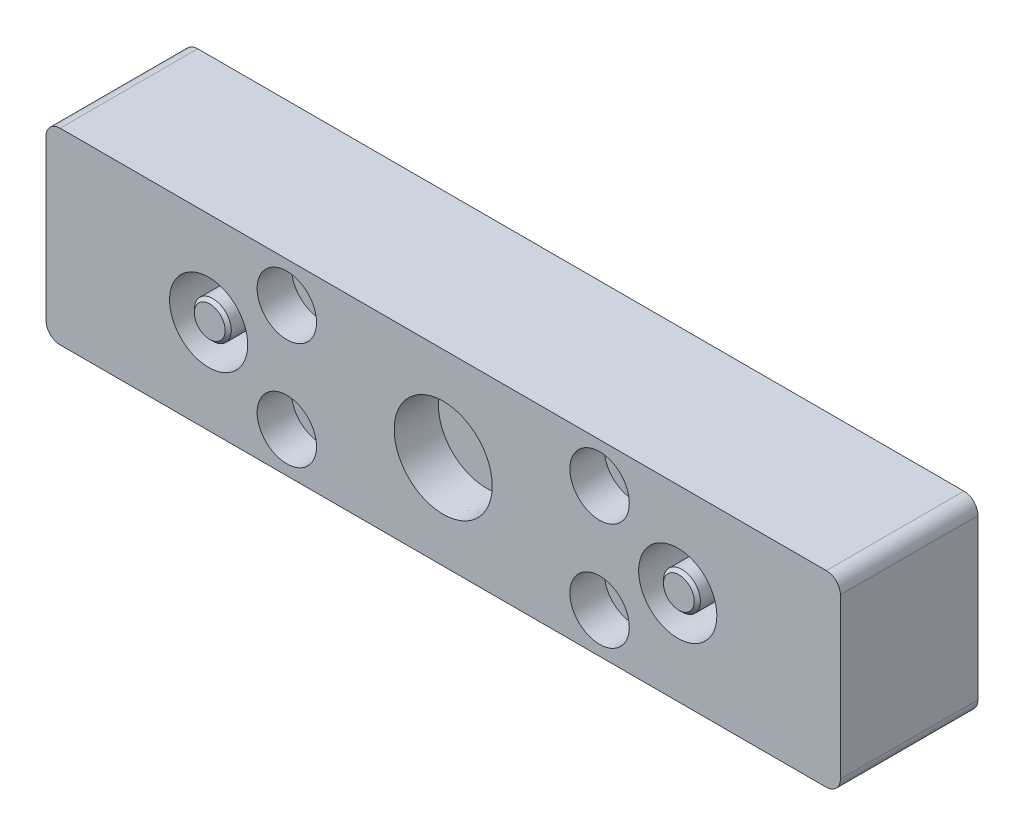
ISO-10303-21;
HEADER;
FILE_DESCRIPTION(('STEP AP214'),'2;1');
FILE_NAME('part.step','',(''),(''),'','','');
FILE_SCHEMA(('AUTOMOTIVE_DESIGN { 1 0 10303 214 1 1 1 1 }'));
ENDSEC;
DATA;
#1=APPLICATION_CONTEXT('core data for automotive mechanical design processes');
#2=APPLICATION_PROTOCOL_DEFINITION('international standard','automotive_design',2000,#1);
#3=PRODUCT_CONTEXT('',#1,'mechanical');
#4=PRODUCT('Part','Part','',(#3));
#5=PRODUCT_RELATED_PRODUCT_CATEGORY('part','',(#4));
#6=PRODUCT_DEFINITION_FORMATION('','',#4);
#7=PRODUCT_DEFINITION_CONTEXT('part definition',#1,'design');
#8=PRODUCT_DEFINITION('design','',#6,#7);
#9=PRODUCT_DEFINITION_SHAPE('','',#8);
#10=(LENGTH_UNIT() NAMED_UNIT(*) SI_UNIT(.MILLI.,.METRE.));
#11=(NAMED_UNIT(*) PLANE_ANGLE_UNIT() SI_UNIT($,.RADIAN.));
#12=(NAMED_UNIT(*) SI_UNIT($,.STERADIAN.) SOLID_ANGLE_UNIT());
#13=UNCERTAINTY_MEASURE_WITH_UNIT(LENGTH_MEASURE(1.E-05),#10,'distance_accuracy_value','');
#14=(GEOMETRIC_REPRESENTATION_CONTEXT(3) GLOBAL_UNCERTAINTY_ASSIGNED_CONTEXT((#13)) GLOBAL_UNIT_ASSIGNED_CONTEXT((#10,
#11,#12)) REPRESENTATION_CONTEXT('',''));
#15=CARTESIAN_POINT('',(0.,0.,0.));
#16=DIRECTION('',(0.,0.,1.));
#17=DIRECTION('',(1.,0.,0.));
#18=AXIS2_PLACEMENT_3D('',#15,#16,#17);
#19=CARTESIAN_POINT('',(40.1,-1.15470053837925,5.599));
#20=DIRECTION('',(-1.,0.,0.));
#21=DIRECTION('',(0.,0.,1.));
#22=AXIS2_PLACEMENT_3D('',#19,#20,#21);
#23=PLANE('',#22);
#24=DIRECTION('',(0.,-1.,0.));
#25=VECTOR('',#24,1.);
#26=CARTESIAN_POINT('',(40.1,0.,5.171821));
#27=LINE('',#26,#25);
#28=CARTESIAN_POINT('',(40.1,1.15470053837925,5.171821));
#29=VERTEX_POINT('',#28);
#30=CARTESIAN_POINT('',(40.1,-1.15470053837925,5.171821));
#31=VERTEX_POINT('',#30);
#32=EDGE_CURVE('E232',#29,#31,#27,.T.);
#33=ORIENTED_EDGE('',*,*,#32,.F.);
#34=DIRECTION('',(0.,0.,-1.));
#35=VECTOR('',#34,1.);
#36=CARTESIAN_POINT('',(40.1,1.15470053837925,5.599));
#37=LINE('',#36,#35);
#38=CARTESIAN_POINT('',(40.1,1.15470053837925,2.17000000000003));
#39=VERTEX_POINT('',#38);
#40=EDGE_CURVE('E115',#29,#39,#37,.T.);
#41=ORIENTED_EDGE('',*,*,#40,.T.);
#42=DIRECTION('',(0.,1.,0.));
#43=VECTOR('',#42,1.);
#44=CARTESIAN_POINT('',(40.1,-1.15470053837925,2.17000000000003));
#45=LINE('',#44,#43);
#46=CARTESIAN_POINT('',(40.1,-1.15470053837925,2.17000000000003));
#47=VERTEX_POINT('',#46);
#48=EDGE_CURVE('E100',#47,#39,#45,.T.);
#49=ORIENTED_EDGE('',*,*,#48,.F.);
#50=DIRECTION('',(0.,0.,-1.));
#51=VECTOR('',#50,1.);
#52=CARTESIAN_POINT('',(40.1,-1.15470053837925,5.599));
#53=LINE('',#52,#51);
#54=EDGE_CURVE('E96',#31,#47,#53,.T.);
#55=ORIENTED_EDGE('',*,*,#54,.F.);
#56=EDGE_LOOP('',(#33,#41,#49,#55));
#57=FACE_BOUND('',#56,.T.);
#58=ADVANCED_FACE('F16',(#57),#23,.T.);
#59=CARTESIAN_POINT('',(40.1,1.15470053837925,5.599));
#60=DIRECTION('',(-0.5,-0.866025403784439,0.));
#61=DIRECTION('',(0.866025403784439,-0.5,0.));
#62=AXIS2_PLACEMENT_3D('',#59,#60,#61);
#63=PLANE('',#62);
#64=DIRECTION('',(0.866025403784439,-0.5,0.));
#65=VECTOR('',#64,1.);
#66=CARTESIAN_POINT('',(39.1,1.73205080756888,5.171821));
#67=LINE('',#66,#65);
#68=CARTESIAN_POINT('',(38.1,2.30940107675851,5.171821));
#69=VERTEX_POINT('',#68);
#70=EDGE_CURVE('E229',#69,#29,#67,.T.);
#71=ORIENTED_EDGE('',*,*,#70,.F.);
#72=DIRECTION('',(0.,0.,-1.));
#73=VECTOR('',#72,1.);
#74=CARTESIAN_POINT('',(38.1,2.30940107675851,5.599));
#75=LINE('',#74,#73);
#76=CARTESIAN_POINT('',(38.1,2.30940107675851,2.17000000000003));
#77=VERTEX_POINT('',#76);
#78=EDGE_CURVE('E113',#69,#77,#75,.T.);
#79=ORIENTED_EDGE('',*,*,#78,.T.);
#80=DIRECTION('',(-0.866025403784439,0.5,0.));
#81=VECTOR('',#80,1.);
#82=CARTESIAN_POINT('',(40.1,1.15470053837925,2.17000000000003));
#83=LINE('',#82,#81);
#84=EDGE_CURVE('E172',#39,#77,#83,.T.);
#85=ORIENTED_EDGE('',*,*,#84,.F.);
#86=ORIENTED_EDGE('',*,*,#40,.F.);
#87=EDGE_LOOP('',(#71,#79,#85,#86));
#88=FACE_BOUND('',#87,.T.);
#89=ADVANCED_FACE('F198',(#88),#63,.T.);
#90=CARTESIAN_POINT('',(38.1,2.30940107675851,5.599));
#91=DIRECTION('',(0.5,-0.866025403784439,0.));
#92=DIRECTION('',(0.866025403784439,0.5,0.));
#93=AXIS2_PLACEMENT_3D('',#90,#91,#92);
#94=PLANE('',#93);
#95=DIRECTION('',(0.866025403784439,0.5,0.));
#96=VECTOR('',#95,1.);
#97=CARTESIAN_POINT('',(37.1,1.73205080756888,5.171821));
#98=LINE('',#97,#96);
#99=CARTESIAN_POINT('',(36.1,1.15470053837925,5.171821));
#100=VERTEX_POINT('',#99);
#101=EDGE_CURVE('E183',#100,#69,#98,.T.);
#102=ORIENTED_EDGE('',*,*,#101,.F.);
#103=DIRECTION('',(0.,0.,-1.));
#104=VECTOR('',#103,1.);
#105=CARTESIAN_POINT('',(36.1,1.15470053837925,5.599));
#106=LINE('',#105,#104);
#107=CARTESIAN_POINT('',(36.1,1.15470053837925,2.17000000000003));
#108=VERTEX_POINT('',#107);
#109=EDGE_CURVE('E111',#100,#108,#106,.T.);
#110=ORIENTED_EDGE('',*,*,#109,.T.);
#111=DIRECTION('',(-0.866025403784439,-0.5,0.));
#112=VECTOR('',#111,1.);
#113=CARTESIAN_POINT('',(38.1,2.30940107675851,2.17000000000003));
#114=LINE('',#113,#112);
#115=EDGE_CURVE('E106',#77,#108,#114,.T.);
#116=ORIENTED_EDGE('',*,*,#115,.F.);
#117=ORIENTED_EDGE('',*,*,#78,.F.);
#118=EDGE_LOOP('',(#102,#110,#116,#117));
#119=FACE_BOUND('',#118,.T.);
#120=ADVANCED_FACE('F179',(#119),#94,.T.);
#121=CARTESIAN_POINT('',(36.1,1.15470053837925,5.599));
#122=DIRECTION('',(1.,0.,0.));
#123=DIRECTION('',(0.,0.,-1.));
#124=AXIS2_PLACEMENT_3D('',#121,#122,#123);
#125=PLANE('',#124);
#126=DIRECTION('',(0.,1.,0.));
#127=VECTOR('',#126,1.);
#128=CARTESIAN_POINT('',(36.1,0.,5.171821));
#129=LINE('',#128,#127);
#130=CARTESIAN_POINT('',(36.1,-1.15470053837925,5.171821));
#131=VERTEX_POINT('',#130);
#132=EDGE_CURVE('E187',#131,#100,#129,.T.);
#133=ORIENTED_EDGE('',*,*,#132,.F.);
#134=DIRECTION('',(0.,0.,-1.));
#135=VECTOR('',#134,1.);
#136=CARTESIAN_POINT('',(36.1,-1.15470053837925,5.599));
#137=LINE('',#136,#135);
#138=CARTESIAN_POINT('',(36.1,-1.15470053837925,2.17000000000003));
#139=VERTEX_POINT('',#138);
#140=EDGE_CURVE('E77',#131,#139,#137,.T.);
#141=ORIENTED_EDGE('',*,*,#140,.T.);
#142=DIRECTION('',(0.,-1.,0.));
#143=VECTOR('',#142,1.);
#144=CARTESIAN_POINT('',(36.1,1.15470053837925,2.17000000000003));
#145=LINE('',#144,#143);
#146=EDGE_CURVE('E104',#108,#139,#145,.T.);
#147=ORIENTED_EDGE('',*,*,#146,.F.);
#148=ORIENTED_EDGE('',*,*,#109,.F.);
#149=EDGE_LOOP('',(#133,#141,#147,#148));
#150=FACE_BOUND('',#149,.T.);
#151=ADVANCED_FACE('F184',(#150),#125,.T.);
#152=CARTESIAN_POINT('',(38.1,0.,2.17000000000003));
#153=DIRECTION('',(0.,0.,-1.));
#154=DIRECTION('',(-1.,0.,0.));
#155=AXIS2_PLACEMENT_3D('',#152,#153,#154);
#156=PLANE('',#155);
#157=CARTESIAN_POINT('',(38.1,0.,2.17000000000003));
#158=DIRECTION('',(0.,0.,-1.));
#159=DIRECTION('',(-1.,0.,0.));
#160=AXIS2_PLACEMENT_3D('',#157,#158,#159);
#161=CIRCLE('',#160,6.72);
#162=CARTESIAN_POINT('',(31.38,0.,2.17000000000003));
#163=VERTEX_POINT('',#162);
#164=EDGE_CURVE('E118',#163,#163,#161,.T.);
#165=ORIENTED_EDGE('',*,*,#164,.T.);
#166=EDGE_LOOP('',(#165));
#167=FACE_BOUND('',#166,.T.);
#168=DIRECTION('',(0.866025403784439,-0.5,0.));
#169=VECTOR('',#168,1.);
#170=CARTESIAN_POINT('',(36.1,-1.15470053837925,2.17000000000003));
#171=LINE('',#170,#169);
#172=CARTESIAN_POINT('',(38.1,-2.3094010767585,2.17000000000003));
#173=VERTEX_POINT('',#172);
#174=EDGE_CURVE('E86',#139,#173,#171,.T.);
#175=ORIENTED_EDGE('',*,*,#174,.T.);
#176=DIRECTION('',(0.866025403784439,0.5,0.));
#177=VECTOR('',#176,1.);
#178=CARTESIAN_POINT('',(38.1,-2.3094010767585,2.17000000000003));
#179=LINE('',#178,#177);
#180=EDGE_CURVE('E93',#173,#47,#179,.T.);
#181=ORIENTED_EDGE('',*,*,#180,.T.);
#182=ORIENTED_EDGE('',*,*,#48,.T.);
#183=ORIENTED_EDGE('',*,*,#84,.T.);
#184=ORIENTED_EDGE('',*,*,#115,.T.);
#185=ORIENTED_EDGE('',*,*,#146,.T.);
#186=EDGE_LOOP('',(#175,#181,#182,#183,#184,#185));
#187=FACE_BOUND('',#186,.T.);
#188=ADVANCED_FACE('F102',(#167,#187),#156,.T.);
#189=CARTESIAN_POINT('',(38.1,-2.3094010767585,5.599));
#190=DIRECTION('',(-0.5,0.866025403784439,0.));
#191=DIRECTION('',(-0.866025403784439,-0.5,0.));
#192=AXIS2_PLACEMENT_3D('',#189,#190,#191);
#193=PLANE('',#192);
#194=DIRECTION('',(-0.866025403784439,-0.5,0.));
#195=VECTOR('',#194,1.);
#196=CARTESIAN_POINT('',(39.1,-1.73205080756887,5.171821));
#197=LINE('',#196,#195);
#198=CARTESIAN_POINT('',(38.1,-2.30940107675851,5.171821));
#199=VERTEX_POINT('',#198);
#200=EDGE_CURVE('E35',#31,#199,#197,.T.);
#201=ORIENTED_EDGE('',*,*,#200,.F.);
#202=ORIENTED_EDGE('',*,*,#54,.T.);
#203=ORIENTED_EDGE('',*,*,#180,.F.);
#204=DIRECTION('',(0.,0.,-1.));
#205=VECTOR('',#204,1.);
#206=CARTESIAN_POINT('',(38.1,-2.3094010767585,5.599));
#207=LINE('',#206,#205);
#208=EDGE_CURVE('E82',#199,#173,#207,.T.);
#209=ORIENTED_EDGE('',*,*,#208,.F.);
#210=EDGE_LOOP('',(#201,#202,#203,#209));
#211=FACE_BOUND('',#210,.T.);
#212=ADVANCED_FACE('F94',(#211),#193,.T.);
#213=CARTESIAN_POINT('',(36.1,-1.15470053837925,5.599));
#214=DIRECTION('',(0.5,0.866025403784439,0.));
#215=DIRECTION('',(-0.866025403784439,0.5,0.));
#216=AXIS2_PLACEMENT_3D('',#213,#214,#215);
#217=PLANE('',#216);
#218=DIRECTION('',(-0.866025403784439,0.5,0.));
#219=VECTOR('',#218,1.);
#220=CARTESIAN_POINT('',(37.1,-1.73205080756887,5.171821));
#221=LINE('',#220,#219);
#222=EDGE_CURVE('E90',#199,#131,#221,.T.);
#223=ORIENTED_EDGE('',*,*,#222,.F.);
#224=ORIENTED_EDGE('',*,*,#208,.T.);
#225=ORIENTED_EDGE('',*,*,#174,.F.);
#226=ORIENTED_EDGE('',*,*,#140,.F.);
#227=EDGE_LOOP('',(#223,#224,#225,#226));
#228=FACE_BOUND('',#227,.T.);
#229=ADVANCED_FACE('F84',(#228),#217,.T.);
#230=CARTESIAN_POINT('',(38.1,0.,2.17000000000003));
#231=DIRECTION('',(0.,0.,-1.));
#232=DIRECTION('',(-1.,0.,0.));
#233=AXIS2_PLACEMENT_3D('',#230,#231,#232);
#234=CYLINDRICAL_SURFACE('',#233,6.72);
#235=CARTESIAN_POINT('',(38.1,0.,2.297));
#236=DIRECTION('',(0.,0.,-1.));
#237=DIRECTION('',(-1.,0.,0.));
#238=AXIS2_PLACEMENT_3D('',#235,#236,#237);
#239=CIRCLE('',#238,6.72);
#240=CARTESIAN_POINT('',(31.38,0.,2.297));
#241=VERTEX_POINT('',#240);
#242=EDGE_CURVE('E26',#241,#241,#239,.F.);
#243=ORIENTED_EDGE('',*,*,#242,.F.);
#244=EDGE_LOOP('',(#243));
#245=FACE_BOUND('',#244,.T.);
#246=ORIENTED_EDGE('',*,*,#164,.F.);
#247=EDGE_LOOP('',(#246));
#248=FACE_BOUND('',#247,.T.);
#249=ADVANCED_FACE('F197',(#245,#248),#234,.T.);
#250=CARTESIAN_POINT('',(38.1,0.,5.171821));
#251=DIRECTION('',(0.,0.,1.));
#252=DIRECTION('',(1.,0.,0.));
#253=AXIS2_PLACEMENT_3D('',#250,#251,#252);
#254=PLANE('',#253);
#255=ORIENTED_EDGE('',*,*,#32,.T.);
#256=ORIENTED_EDGE('',*,*,#200,.T.);
#257=ORIENTED_EDGE('',*,*,#222,.T.);
#258=ORIENTED_EDGE('',*,*,#132,.T.);
#259=ORIENTED_EDGE('',*,*,#101,.T.);
#260=ORIENTED_EDGE('',*,*,#70,.T.);
#261=EDGE_LOOP('',(#255,#256,#257,#258,#259,#260));
#262=FACE_BOUND('',#261,.T.);
#263=ADVANCED_FACE('F214',(#262),#254,.F.);
#264=CARTESIAN_POINT('',(-36.1,-1.15470053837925,5.599));
#265=DIRECTION('',(-1.,0.,0.));
#266=DIRECTION('',(0.,0.,1.));
#267=AXIS2_PLACEMENT_3D('',#264,#265,#266);
#268=PLANE('',#267);
#269=DIRECTION('',(0.,-1.,0.));
#270=VECTOR('',#269,1.);
#271=CARTESIAN_POINT('',(-36.1,0.,5.171821));
#272=LINE('',#271,#270);
#273=CARTESIAN_POINT('',(-36.1,1.15470053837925,5.171821));
#274=VERTEX_POINT('',#273);
#275=CARTESIAN_POINT('',(-36.1,-1.15470053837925,5.171821));
#276=VERTEX_POINT('',#275);
#277=EDGE_CURVE('E386',#274,#276,#272,.T.);
#278=ORIENTED_EDGE('',*,*,#277,.F.);
#279=DIRECTION('',(0.,0.,-1.));
#280=VECTOR('',#279,1.);
#281=CARTESIAN_POINT('',(-36.1,1.15470053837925,5.599));
#282=LINE('',#281,#280);
#283=CARTESIAN_POINT('',(-36.1,1.15470053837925,2.17));
#284=VERTEX_POINT('',#283);
#285=EDGE_CURVE('E157',#274,#284,#282,.T.);
#286=ORIENTED_EDGE('',*,*,#285,.T.);
#287=DIRECTION('',(0.,1.,0.));
#288=VECTOR('',#287,1.);
#289=CARTESIAN_POINT('',(-36.1,-1.15470053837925,2.17));
#290=LINE('',#289,#288);
#291=CARTESIAN_POINT('',(-36.1,-1.15470053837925,2.17));
#292=VERTEX_POINT('',#291);
#293=EDGE_CURVE('E129',#292,#284,#290,.T.);
#294=ORIENTED_EDGE('',*,*,#293,.F.);
#295=DIRECTION('',(0.,0.,-1.));
#296=VECTOR('',#295,1.);
#297=CARTESIAN_POINT('',(-36.1,-1.15470053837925,5.599));
#298=LINE('',#297,#296);
#299=EDGE_CURVE('E159',#276,#292,#298,.T.);
#300=ORIENTED_EDGE('',*,*,#299,.F.);
#301=EDGE_LOOP('',(#278,#286,#294,#300));
#302=FACE_BOUND('',#301,.T.);
#303=ADVANCED_FACE('F517',(#302),#268,.T.);
#304=CARTESIAN_POINT('',(-36.1,1.15470053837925,5.599));
#305=DIRECTION('',(-0.5,-0.866025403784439,0.));
#306=DIRECTION('',(0.866025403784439,-0.5,0.));
#307=AXIS2_PLACEMENT_3D('',#304,#305,#306);
#308=PLANE('',#307);
#309=DIRECTION('',(0.866025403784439,-0.5,0.));
#310=VECTOR('',#309,1.);
#311=CARTESIAN_POINT('',(-37.1,1.73205080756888,5.171821));
#312=LINE('',#311,#310);
#313=CARTESIAN_POINT('',(-38.1,2.30940107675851,5.171821));
#314=VERTEX_POINT('',#313);
#315=EDGE_CURVE('E383',#314,#274,#312,.T.);
#316=ORIENTED_EDGE('',*,*,#315,.F.);
#317=DIRECTION('',(0.,0.,-1.));
#318=VECTOR('',#317,1.);
#319=CARTESIAN_POINT('',(-38.1,2.30940107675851,5.599));
#320=LINE('',#319,#318);
#321=CARTESIAN_POINT('',(-38.1,2.30940107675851,2.17));
#322=VERTEX_POINT('',#321);
#323=EDGE_CURVE('E155',#314,#322,#320,.T.);
#324=ORIENTED_EDGE('',*,*,#323,.T.);
#325=DIRECTION('',(-0.866025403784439,0.5,0.));
#326=VECTOR('',#325,1.);
#327=CARTESIAN_POINT('',(-36.1,1.15470053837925,2.17));
#328=LINE('',#327,#326);
#329=EDGE_CURVE('E135',#284,#322,#328,.T.);
#330=ORIENTED_EDGE('',*,*,#329,.F.);
#331=ORIENTED_EDGE('',*,*,#285,.F.);
#332=EDGE_LOOP('',(#316,#324,#330,#331));
#333=FACE_BOUND('',#332,.T.);
#334=ADVANCED_FACE('F513',(#333),#308,.T.);
#335=CARTESIAN_POINT('',(-38.1,2.30940107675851,5.599));
#336=DIRECTION('',(0.5,-0.866025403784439,0.));
#337=DIRECTION('',(0.866025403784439,0.5,0.));
#338=AXIS2_PLACEMENT_3D('',#335,#336,#337);
#339=PLANE('',#338);
#340=DIRECTION('',(0.866025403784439,0.5,0.));
#341=VECTOR('',#340,1.);
#342=CARTESIAN_POINT('',(-39.1,1.73205080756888,5.171821));
#343=LINE('',#342,#341);
#344=CARTESIAN_POINT('',(-40.1,1.15470053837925,5.171821));
#345=VERTEX_POINT('',#344);
#346=EDGE_CURVE('E380',#345,#314,#343,.T.);
#347=ORIENTED_EDGE('',*,*,#346,.F.);
#348=DIRECTION('',(0.,0.,-1.));
#349=VECTOR('',#348,1.);
#350=CARTESIAN_POINT('',(-40.1,1.15470053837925,5.599));
#351=LINE('',#350,#349);
#352=CARTESIAN_POINT('',(-40.1,1.15470053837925,2.17));
#353=VERTEX_POINT('',#352);
#354=EDGE_CURVE('E153',#345,#353,#351,.T.);
#355=ORIENTED_EDGE('',*,*,#354,.T.);
#356=DIRECTION('',(-0.866025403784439,-0.5,0.));
#357=VECTOR('',#356,1.);
#358=CARTESIAN_POINT('',(-38.1,2.30940107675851,2.17));
#359=LINE('',#358,#357);
#360=EDGE_CURVE('E141',#322,#353,#359,.T.);
#361=ORIENTED_EDGE('',*,*,#360,.F.);
#362=ORIENTED_EDGE('',*,*,#323,.F.);
#363=EDGE_LOOP('',(#347,#355,#361,#362));
#364=FACE_BOUND('',#363,.T.);
#365=ADVANCED_FACE('F509',(#364),#339,.T.);
#366=CARTESIAN_POINT('',(-40.1,1.15470053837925,5.599));
#367=DIRECTION('',(1.,0.,0.));
#368=DIRECTION('',(0.,0.,-1.));
#369=AXIS2_PLACEMENT_3D('',#366,#367,#368);
#370=PLANE('',#369);
#371=DIRECTION('',(0.,1.,0.));
#372=VECTOR('',#371,1.);
#373=CARTESIAN_POINT('',(-40.1,0.,5.171821));
#374=LINE('',#373,#372);
#375=CARTESIAN_POINT('',(-40.1,-1.15470053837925,5.171821));
#376=VERTEX_POINT('',#375);
#377=EDGE_CURVE('E377',#376,#345,#374,.T.);
#378=ORIENTED_EDGE('',*,*,#377,.F.);
#379=DIRECTION('',(0.,0.,-1.));
#380=VECTOR('',#379,1.);
#381=CARTESIAN_POINT('',(-40.1,-1.15470053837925,5.599));
#382=LINE('',#381,#380);
#383=CARTESIAN_POINT('',(-40.1,-1.15470053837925,2.17));
#384=VERTEX_POINT('',#383);
#385=EDGE_CURVE('E151',#376,#384,#382,.T.);
#386=ORIENTED_EDGE('',*,*,#385,.T.);
#387=DIRECTION('',(0.,-1.,0.));
#388=VECTOR('',#387,1.);
#389=CARTESIAN_POINT('',(-40.1,1.15470053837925,2.17));
#390=LINE('',#389,#388);
#391=EDGE_CURVE('E144',#353,#384,#390,.T.);
#392=ORIENTED_EDGE('',*,*,#391,.F.);
#393=ORIENTED_EDGE('',*,*,#354,.F.);
#394=EDGE_LOOP('',(#378,#386,#392,#393));
#395=FACE_BOUND('',#394,.T.);
#396=ADVANCED_FACE('F506',(#395),#370,.T.);
#397=CARTESIAN_POINT('',(-38.1,0.,2.17));
#398=DIRECTION('',(0.,0.,-1.));
#399=DIRECTION('',(-1.,0.,0.));
#400=AXIS2_PLACEMENT_3D('',#397,#398,#399);
#401=PLANE('',#400);
#402=CARTESIAN_POINT('',(-38.1,0.,2.17));
#403=DIRECTION('',(0.,0.,-1.));
#404=DIRECTION('',(-1.,0.,0.));
#405=AXIS2_PLACEMENT_3D('',#402,#403,#404);
#406=CIRCLE('',#405,6.72);
#407=CARTESIAN_POINT('',(-44.82,0.,2.17));
#408=VERTEX_POINT('',#407);
#409=EDGE_CURVE('E161',#408,#408,#406,.T.);
#410=ORIENTED_EDGE('',*,*,#409,.T.);
#411=EDGE_LOOP('',(#410));
#412=FACE_BOUND('',#411,.T.);
#413=DIRECTION('',(0.866025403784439,-0.5,0.));
#414=VECTOR('',#413,1.);
#415=CARTESIAN_POINT('',(-40.1,-1.15470053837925,2.17));
#416=LINE('',#415,#414);
#417=CARTESIAN_POINT('',(-38.1,-2.3094010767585,2.17));
#418=VERTEX_POINT('',#417);
#419=EDGE_CURVE('E147',#384,#418,#416,.T.);
#420=ORIENTED_EDGE('',*,*,#419,.T.);
#421=DIRECTION('',(0.866025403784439,0.5,0.));
#422=VECTOR('',#421,1.);
#423=CARTESIAN_POINT('',(-38.1,-2.3094010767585,2.17));
#424=LINE('',#423,#422);
#425=EDGE_CURVE('E125',#418,#292,#424,.T.);
#426=ORIENTED_EDGE('',*,*,#425,.T.);
#427=ORIENTED_EDGE('',*,*,#293,.T.);
#428=ORIENTED_EDGE('',*,*,#329,.T.);
#429=ORIENTED_EDGE('',*,*,#360,.T.);
#430=ORIENTED_EDGE('',*,*,#391,.T.);
#431=EDGE_LOOP('',(#420,#426,#427,#428,#429,#430));
#432=FACE_BOUND('',#431,.T.);
#433=ADVANCED_FACE('F505',(#412,#432),#401,.T.);
#434=CARTESIAN_POINT('',(-38.1,-2.3094010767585,5.599));
#435=DIRECTION('',(-0.5,0.866025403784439,0.));
#436=DIRECTION('',(-0.866025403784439,-0.5,0.));
#437=AXIS2_PLACEMENT_3D('',#434,#435,#436);
#438=PLANE('',#437);
#439=DIRECTION('',(-0.866025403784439,-0.5,0.));
#440=VECTOR('',#439,1.);
#441=CARTESIAN_POINT('',(-37.1,-1.73205080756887,5.171821));
#442=LINE('',#441,#440);
#443=CARTESIAN_POINT('',(-38.1,-2.30940107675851,5.171821));
#444=VERTEX_POINT('',#443);
#445=EDGE_CURVE('E389',#276,#444,#442,.T.);
#446=ORIENTED_EDGE('',*,*,#445,.F.);
#447=ORIENTED_EDGE('',*,*,#299,.T.);
#448=ORIENTED_EDGE('',*,*,#425,.F.);
#449=DIRECTION('',(0.,0.,-1.));
#450=VECTOR('',#449,1.);
#451=CARTESIAN_POINT('',(-38.1,-2.3094010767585,5.599));
#452=LINE('',#451,#450);
#453=EDGE_CURVE('E149',#444,#418,#452,.T.);
#454=ORIENTED_EDGE('',*,*,#453,.F.);
#455=EDGE_LOOP('',(#446,#447,#448,#454));
#456=FACE_BOUND('',#455,.T.);
#457=ADVANCED_FACE('F503',(#456),#438,.T.);
#458=CARTESIAN_POINT('',(-40.1,-1.15470053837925,5.599));
#459=DIRECTION('',(0.5,0.866025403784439,0.));
#460=DIRECTION('',(-0.866025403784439,0.5,0.));
#461=AXIS2_PLACEMENT_3D('',#458,#459,#460);
#462=PLANE('',#461);
#463=DIRECTION('',(-0.866025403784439,0.5,0.));
#464=VECTOR('',#463,1.);
#465=CARTESIAN_POINT('',(-39.1,-1.73205080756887,5.171821));
#466=LINE('',#465,#464);
#467=EDGE_CURVE('E374',#444,#376,#466,.T.);
#468=ORIENTED_EDGE('',*,*,#467,.F.);
#469=ORIENTED_EDGE('',*,*,#453,.T.);
#470=ORIENTED_EDGE('',*,*,#419,.F.);
#471=ORIENTED_EDGE('',*,*,#385,.F.);
#472=EDGE_LOOP('',(#468,#469,#470,#471));
#473=FACE_BOUND('',#472,.T.);
#474=ADVANCED_FACE('F499',(#473),#462,.T.);
#475=CARTESIAN_POINT('',(-38.1,0.,2.17));
#476=DIRECTION('',(0.,0.,-1.));
#477=DIRECTION('',(-1.,0.,0.));
#478=AXIS2_PLACEMENT_3D('',#475,#476,#477);
#479=CYLINDRICAL_SURFACE('',#478,6.72);
#480=CARTESIAN_POINT('',(-38.1,0.,2.297));
#481=DIRECTION('',(0.,0.,-1.));
#482=DIRECTION('',(-1.,0.,0.));
#483=AXIS2_PLACEMENT_3D('',#480,#481,#482);
#484=CIRCLE('',#483,6.72);
#485=CARTESIAN_POINT('',(-44.82,0.,2.297));
#486=VERTEX_POINT('',#485);
#487=EDGE_CURVE('E10',#486,#486,#484,.F.);
#488=ORIENTED_EDGE('',*,*,#487,.F.);
#489=EDGE_LOOP('',(#488));
#490=FACE_BOUND('',#489,.T.);
#491=ORIENTED_EDGE('',*,*,#409,.F.);
#492=EDGE_LOOP('',(#491));
#493=FACE_BOUND('',#492,.T.);
#494=ADVANCED_FACE('F502',(#490,#493),#479,.T.);
#495=CARTESIAN_POINT('',(-38.1,0.,5.171821));
#496=DIRECTION('',(0.,0.,1.));
#497=DIRECTION('',(1.,0.,0.));
#498=AXIS2_PLACEMENT_3D('',#495,#496,#497);
#499=PLANE('',#498);
#500=ORIENTED_EDGE('',*,*,#277,.T.);
#501=ORIENTED_EDGE('',*,*,#445,.T.);
#502=ORIENTED_EDGE('',*,*,#467,.T.);
#503=ORIENTED_EDGE('',*,*,#377,.T.);
#504=ORIENTED_EDGE('',*,*,#346,.T.);
#505=ORIENTED_EDGE('',*,*,#315,.T.);
#506=EDGE_LOOP('',(#500,#501,#502,#503,#504,#505));
#507=FACE_BOUND('',#506,.T.);
#508=ADVANCED_FACE('F216',(#507),#499,.F.);
#509=CARTESIAN_POINT('',(-64.516,15.24,15.367));
#510=DIRECTION('',(0.,0.,-1.));
#511=DIRECTION('',(-1.,0.,0.));
#512=AXIS2_PLACEMENT_3D('',#509,#510,#511);
#513=PLANE('',#512);
#514=CARTESIAN_POINT('',(0.,0.,15.367));
#515=DIRECTION('',(0.,0.,-1.));
#516=DIRECTION('',(-1.,0.,0.));
#517=AXIS2_PLACEMENT_3D('',#514,#515,#516);
#518=CIRCLE('',#517,7.75388674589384);
#519=CARTESIAN_POINT('',(-7.75388674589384,0.,15.367));
#520=VERTEX_POINT('',#519);
#521=EDGE_CURVE('E352',#520,#520,#518,.F.);
#522=ORIENTED_EDGE('',*,*,#521,.T.);
#523=EDGE_LOOP('',(#522));
#524=FACE_BOUND('',#523,.T.);
#525=ADVANCED_FACE('F556',(#524),#513,.F.);
#526=CARTESIAN_POINT('',(-25.4,8.73125,16.764));
#527=DIRECTION('',(0.,0.,1.));
#528=DIRECTION('',(1.,0.,0.));
#529=AXIS2_PLACEMENT_3D('',#526,#527,#528);
#530=PLANE('',#529);
#531=CARTESIAN_POINT('',(-25.4,8.73125,16.764));
#532=DIRECTION('',(0.,0.,1.));
#533=DIRECTION('',(1.,0.,0.));
#534=AXIS2_PLACEMENT_3D('',#531,#532,#533);
#535=CIRCLE('',#534,4.826);
#536=CARTESIAN_POINT('',(-20.574,8.73125,16.764));
#537=VERTEX_POINT('',#536);
#538=EDGE_CURVE('E356',#537,#537,#535,.T.);
#539=ORIENTED_EDGE('',*,*,#538,.T.);
#540=EDGE_LOOP('',(#539));
#541=FACE_BOUND('',#540,.T.);
#542=CARTESIAN_POINT('',(-25.4,8.73125,16.764));
#543=DIRECTION('',(0.,0.,1.));
#544=DIRECTION('',(1.,0.,0.));
#545=AXIS2_PLACEMENT_3D('',#542,#543,#544);
#546=CIRCLE('',#545,2.5527);
#547=CARTESIAN_POINT('',(-22.8473,8.73125,16.764));
#548=VERTEX_POINT('',#547);
#549=EDGE_CURVE('E353',#548,#548,#546,.F.);
#550=ORIENTED_EDGE('',*,*,#549,.T.);
#551=EDGE_LOOP('',(#550));
#552=FACE_BOUND('',#551,.T.);
#553=ADVANCED_FACE('F559',(#541,#552),#530,.T.);
#554=CARTESIAN_POINT('',(-25.4,-8.73125,16.764));
#555=DIRECTION('',(0.,0.,1.));
#556=DIRECTION('',(1.,0.,0.));
#557=AXIS2_PLACEMENT_3D('',#554,#555,#556);
#558=PLANE('',#557);
#559=CARTESIAN_POINT('',(-25.4,-8.73125,16.764));
#560=DIRECTION('',(0.,0.,1.));
#561=DIRECTION('',(1.,0.,0.));
#562=AXIS2_PLACEMENT_3D('',#559,#560,#561);
#563=CIRCLE('',#562,4.826);
#564=CARTESIAN_POINT('',(-20.574,-8.73125,16.764));
#565=VERTEX_POINT('',#564);
#566=EDGE_CURVE('E361',#565,#565,#563,.T.);
#567=ORIENTED_EDGE('',*,*,#566,.T.);
#568=EDGE_LOOP('',(#567));
#569=FACE_BOUND('',#568,.T.);
#570=CARTESIAN_POINT('',(-25.4,-8.73125,16.764));
#571=DIRECTION('',(0.,0.,1.));
#572=DIRECTION('',(1.,0.,0.));
#573=AXIS2_PLACEMENT_3D('',#570,#571,#572);
#574=CIRCLE('',#573,2.5527);
#575=CARTESIAN_POINT('',(-22.8473,-8.73125,16.764));
#576=VERTEX_POINT('',#575);
#577=EDGE_CURVE('E357',#576,#576,#574,.F.);
#578=ORIENTED_EDGE('',*,*,#577,.T.);
#579=EDGE_LOOP('',(#578));
#580=FACE_BOUND('',#579,.T.);
#581=ADVANCED_FACE('F572',(#569,#580),#558,.T.);
#582=CARTESIAN_POINT('',(25.4,8.73125,16.764));
#583=DIRECTION('',(0.,0.,1.));
#584=DIRECTION('',(1.,0.,0.));
#585=AXIS2_PLACEMENT_3D('',#582,#583,#584);
#586=PLANE('',#585);
#587=CARTESIAN_POINT('',(25.4,8.73125,16.764));
#588=DIRECTION('',(0.,0.,1.));
#589=DIRECTION('',(1.,0.,0.));
#590=AXIS2_PLACEMENT_3D('',#587,#588,#589);
#591=CIRCLE('',#590,4.826);
#592=CARTESIAN_POINT('',(30.226,8.73125,16.764));
#593=VERTEX_POINT('',#592);
#594=EDGE_CURVE('E366',#593,#593,#591,.T.);
#595=ORIENTED_EDGE('',*,*,#594,.T.);
#596=EDGE_LOOP('',(#595));
#597=FACE_BOUND('',#596,.T.);
#598=CARTESIAN_POINT('',(25.4,8.73125,16.764));
#599=DIRECTION('',(0.,0.,1.));
#600=DIRECTION('',(1.,0.,0.));
#601=AXIS2_PLACEMENT_3D('',#598,#599,#600);
#602=CIRCLE('',#601,2.5527);
#603=CARTESIAN_POINT('',(27.9527,8.73125,16.764));
#604=VERTEX_POINT('',#603);
#605=EDGE_CURVE('E362',#604,#604,#602,.F.);
#606=ORIENTED_EDGE('',*,*,#605,.T.);
#607=EDGE_LOOP('',(#606));
#608=FACE_BOUND('',#607,.T.);
#609=ADVANCED_FACE('F563',(#597,#608),#586,.T.);
#610=CARTESIAN_POINT('',(25.4,-8.73125,16.764));
#611=DIRECTION('',(0.,0.,1.));
#612=DIRECTION('',(1.,0.,0.));
#613=AXIS2_PLACEMENT_3D('',#610,#611,#612);
#614=PLANE('',#613);
#615=CARTESIAN_POINT('',(25.4,-8.73125,16.764));
#616=DIRECTION('',(0.,0.,1.));
#617=DIRECTION('',(1.,0.,0.));
#618=AXIS2_PLACEMENT_3D('',#615,#616,#617);
#619=CIRCLE('',#618,4.826);
#620=CARTESIAN_POINT('',(30.226,-8.73125,16.764));
#621=VERTEX_POINT('',#620);
#622=EDGE_CURVE('E371',#621,#621,#619,.T.);
#623=ORIENTED_EDGE('',*,*,#622,.T.);
#624=EDGE_LOOP('',(#623));
#625=FACE_BOUND('',#624,.T.);
#626=CARTESIAN_POINT('',(25.4,-8.73125,16.764));
#627=DIRECTION('',(0.,0.,1.));
#628=DIRECTION('',(1.,0.,0.));
#629=AXIS2_PLACEMENT_3D('',#626,#627,#628);
#630=CIRCLE('',#629,2.5527);
#631=CARTESIAN_POINT('',(27.9527,-8.73125,16.764));
#632=VERTEX_POINT('',#631);
#633=EDGE_CURVE('E367',#632,#632,#630,.F.);
#634=ORIENTED_EDGE('',*,*,#633,.T.);
#635=EDGE_LOOP('',(#634));
#636=FACE_BOUND('',#635,.T.);
#637=ADVANCED_FACE('F496',(#625,#636),#614,.T.);
#638=CARTESIAN_POINT('',(62.23,-12.954,22.352));
#639=DIRECTION('',(0.,0.,-1.));
#640=DIRECTION('',(-1.,0.,0.));
#641=AXIS2_PLACEMENT_3D('',#638,#639,#640);
#642=CYLINDRICAL_SURFACE('',#641,2.286);
#643=CARTESIAN_POINT('',(62.23,-12.954,22.352));
#644=DIRECTION('',(0.,0.,-1.));
#645=DIRECTION('',(-1.,0.,0.));
#646=AXIS2_PLACEMENT_3D('',#643,#644,#645);
#647=CIRCLE('',#646,2.286);
#648=CARTESIAN_POINT('',(62.23,-15.24,22.352));
#649=VERTEX_POINT('',#648);
#650=CARTESIAN_POINT('',(64.516,-12.954,22.352));
#651=VERTEX_POINT('',#650);
#652=EDGE_CURVE('E331',#649,#651,#647,.F.);
#653=ORIENTED_EDGE('',*,*,#652,.F.);
#654=DIRECTION('',(0.,0.,-1.));
#655=VECTOR('',#654,1.);
#656=CARTESIAN_POINT('',(62.23,-15.24,22.352));
#657=LINE('',#656,#655);
#658=CARTESIAN_POINT('',(62.23,-15.24,0.));
#659=VERTEX_POINT('',#658);
#660=EDGE_CURVE('E294',#659,#649,#657,.F.);
#661=ORIENTED_EDGE('',*,*,#660,.F.);
#662=CARTESIAN_POINT('',(62.23,-12.954,0.));
#663=DIRECTION('',(0.,0.,-1.));
#664=DIRECTION('',(-1.,0.,0.));
#665=AXIS2_PLACEMENT_3D('',#662,#663,#664);
#666=CIRCLE('',#665,2.286);
#667=CARTESIAN_POINT('',(64.516,-12.954,0.));
#668=VERTEX_POINT('',#667);
#669=EDGE_CURVE('E313',#668,#659,#666,.T.);
#670=ORIENTED_EDGE('',*,*,#669,.F.);
#671=DIRECTION('',(0.,0.,-1.));
#672=VECTOR('',#671,1.);
#673=CARTESIAN_POINT('',(64.516,-12.954,22.352));
#674=LINE('',#673,#672);
#675=EDGE_CURVE('E349',#651,#668,#674,.T.);
#676=ORIENTED_EDGE('',*,*,#675,.F.);
#677=EDGE_LOOP('',(#653,#661,#670,#676));
#678=FACE_BOUND('',#677,.T.);
#679=ADVANCED_FACE('F460',(#678),#642,.T.);
#680=CARTESIAN_POINT('',(64.516,-15.24,22.352));
#681=DIRECTION('',(-1.,0.,0.));
#682=DIRECTION('',(0.,0.,1.));
#683=AXIS2_PLACEMENT_3D('',#680,#681,#682);
#684=PLANE('',#683);
#685=DIRECTION('',(0.,1.,0.));
#686=VECTOR('',#685,1.);
#687=CARTESIAN_POINT('',(64.516,-15.24,22.352));
#688=LINE('',#687,#686);
#689=CARTESIAN_POINT('',(64.516,12.954,22.352));
#690=VERTEX_POINT('',#689);
#691=EDGE_CURVE('E288',#651,#690,#688,.T.);
#692=ORIENTED_EDGE('',*,*,#691,.F.);
#693=ORIENTED_EDGE('',*,*,#675,.T.);
#694=DIRECTION('',(0.,1.,0.));
#695=VECTOR('',#694,1.);
#696=CARTESIAN_POINT('',(64.516,-15.24,0.));
#697=LINE('',#696,#695);
#698=CARTESIAN_POINT('',(64.516,12.954,0.));
#699=VERTEX_POINT('',#698);
#700=EDGE_CURVE('E300',#668,#699,#697,.T.);
#701=ORIENTED_EDGE('',*,*,#700,.T.);
#702=DIRECTION('',(0.,0.,-1.));
#703=VECTOR('',#702,1.);
#704=CARTESIAN_POINT('',(64.516,12.954,22.352));
#705=LINE('',#704,#703);
#706=EDGE_CURVE('E346',#699,#690,#705,.F.);
#707=ORIENTED_EDGE('',*,*,#706,.T.);
#708=EDGE_LOOP('',(#692,#693,#701,#707));
#709=FACE_BOUND('',#708,.T.);
#710=ADVANCED_FACE('F463',(#709),#684,.F.);
#711=CARTESIAN_POINT('',(62.23,12.954,22.352));
#712=DIRECTION('',(0.,0.,-1.));
#713=DIRECTION('',(-1.,0.,0.));
#714=AXIS2_PLACEMENT_3D('',#711,#712,#713);
#715=CYLINDRICAL_SURFACE('',#714,2.286);
#716=CARTESIAN_POINT('',(62.23,12.954,22.352));
#717=DIRECTION('',(0.,0.,-1.));
#718=DIRECTION('',(-1.,0.,0.));
#719=AXIS2_PLACEMENT_3D('',#716,#717,#718);
#720=CIRCLE('',#719,2.286);
#721=CARTESIAN_POINT('',(62.23,15.24,22.352));
#722=VERTEX_POINT('',#721);
#723=EDGE_CURVE('E328',#690,#722,#720,.F.);
#724=ORIENTED_EDGE('',*,*,#723,.F.);
#725=ORIENTED_EDGE('',*,*,#706,.F.);
#726=CARTESIAN_POINT('',(62.23,12.954,0.));
#727=DIRECTION('',(0.,0.,-1.));
#728=DIRECTION('',(-1.,0.,0.));
#729=AXIS2_PLACEMENT_3D('',#726,#727,#728);
#730=CIRCLE('',#729,2.286);
#731=CARTESIAN_POINT('',(62.23,15.24,0.));
#732=VERTEX_POINT('',#731);
#733=EDGE_CURVE('E310',#732,#699,#730,.T.);
#734=ORIENTED_EDGE('',*,*,#733,.F.);
#735=DIRECTION('',(0.,0.,-1.));
#736=VECTOR('',#735,1.);
#737=CARTESIAN_POINT('',(62.23,15.24,22.352));
#738=LINE('',#737,#736);
#739=EDGE_CURVE('E340',#722,#732,#738,.T.);
#740=ORIENTED_EDGE('',*,*,#739,.F.);
#741=EDGE_LOOP('',(#724,#725,#734,#740));
#742=FACE_BOUND('',#741,.T.);
#743=ADVANCED_FACE('F471',(#742),#715,.T.);
#744=CARTESIAN_POINT('',(-64.516,15.24,22.352));
#745=DIRECTION('',(0.,-1.,0.));
#746=DIRECTION('',(0.,0.,-1.));
#747=AXIS2_PLACEMENT_3D('',#744,#745,#746);
#748=PLANE('',#747);
#749=DIRECTION('',(-1.,0.,0.));
#750=VECTOR('',#749,1.);
#751=CARTESIAN_POINT('',(-64.516,15.24,0.));
#752=LINE('',#751,#750);
#753=CARTESIAN_POINT('',(-62.23,15.24,0.));
#754=VERTEX_POINT('',#753);
#755=EDGE_CURVE('E285',#732,#754,#752,.T.);
#756=ORIENTED_EDGE('',*,*,#755,.T.);
#757=DIRECTION('',(0.,0.,-1.));
#758=VECTOR('',#757,1.);
#759=CARTESIAN_POINT('',(-62.23,15.24,22.352));
#760=LINE('',#759,#758);
#761=CARTESIAN_POINT('',(-62.23,15.24,22.352));
#762=VERTEX_POINT('',#761);
#763=EDGE_CURVE('E343',#754,#762,#760,.F.);
#764=ORIENTED_EDGE('',*,*,#763,.T.);
#765=DIRECTION('',(-1.,0.,0.));
#766=VECTOR('',#765,1.);
#767=CARTESIAN_POINT('',(-64.516,15.24,22.352));
#768=LINE('',#767,#766);
#769=EDGE_CURVE('E291',#722,#762,#768,.T.);
#770=ORIENTED_EDGE('',*,*,#769,.F.);
#771=ORIENTED_EDGE('',*,*,#739,.T.);
#772=EDGE_LOOP('',(#756,#764,#770,#771));
#773=FACE_BOUND('',#772,.T.);
#774=ADVANCED_FACE('F474',(#773),#748,.F.);
#775=CARTESIAN_POINT('',(-62.23,12.954,22.352));
#776=DIRECTION('',(0.,0.,-1.));
#777=DIRECTION('',(-1.,0.,0.));
#778=AXIS2_PLACEMENT_3D('',#775,#776,#777);
#779=CYLINDRICAL_SURFACE('',#778,2.286);
#780=CARTESIAN_POINT('',(-62.23,12.954,22.352));
#781=DIRECTION('',(0.,0.,-1.));
#782=DIRECTION('',(-1.,0.,0.));
#783=AXIS2_PLACEMENT_3D('',#780,#781,#782);
#784=CIRCLE('',#783,2.286);
#785=CARTESIAN_POINT('',(-64.516,12.954,22.352));
#786=VERTEX_POINT('',#785);
#787=EDGE_CURVE('E334',#762,#786,#784,.F.);
#788=ORIENTED_EDGE('',*,*,#787,.F.);
#789=ORIENTED_EDGE('',*,*,#763,.F.);
#790=CARTESIAN_POINT('',(-62.23,12.954,0.));
#791=DIRECTION('',(0.,0.,-1.));
#792=DIRECTION('',(-1.,0.,0.));
#793=AXIS2_PLACEMENT_3D('',#790,#791,#792);
#794=CIRCLE('',#793,2.286);
#795=CARTESIAN_POINT('',(-64.516,12.954,0.));
#796=VERTEX_POINT('',#795);
#797=EDGE_CURVE('E316',#796,#754,#794,.T.);
#798=ORIENTED_EDGE('',*,*,#797,.F.);
#799=DIRECTION('',(0.,0.,-1.));
#800=VECTOR('',#799,1.);
#801=CARTESIAN_POINT('',(-64.516,12.954,22.352));
#802=LINE('',#801,#800);
#803=EDGE_CURVE('E322',#786,#796,#802,.T.);
#804=ORIENTED_EDGE('',*,*,#803,.F.);
#805=EDGE_LOOP('',(#788,#789,#798,#804));
#806=FACE_BOUND('',#805,.T.);
#807=ADVANCED_FACE('F479',(#806),#779,.T.);
#808=CARTESIAN_POINT('',(-64.516,-15.24,22.352));
#809=DIRECTION('',(1.,0.,0.));
#810=DIRECTION('',(0.,0.,-1.));
#811=AXIS2_PLACEMENT_3D('',#808,#809,#810);
#812=PLANE('',#811);
#813=DIRECTION('',(0.,-1.,0.));
#814=VECTOR('',#813,1.);
#815=CARTESIAN_POINT('',(-64.516,-15.24,0.));
#816=LINE('',#815,#814);
#817=CARTESIAN_POINT('',(-64.516,-12.954,0.));
#818=VERTEX_POINT('',#817);
#819=EDGE_CURVE('E278',#796,#818,#816,.T.);
#820=ORIENTED_EDGE('',*,*,#819,.T.);
#821=DIRECTION('',(0.,0.,-1.));
#822=VECTOR('',#821,1.);
#823=CARTESIAN_POINT('',(-64.516,-12.954,22.352));
#824=LINE('',#823,#822);
#825=CARTESIAN_POINT('',(-64.516,-12.954,22.352));
#826=VERTEX_POINT('',#825);
#827=EDGE_CURVE('E325',#818,#826,#824,.F.);
#828=ORIENTED_EDGE('',*,*,#827,.T.);
#829=DIRECTION('',(0.,-1.,0.));
#830=VECTOR('',#829,1.);
#831=CARTESIAN_POINT('',(-64.516,-15.24,22.352));
#832=LINE('',#831,#830);
#833=EDGE_CURVE('E281',#786,#826,#832,.T.);
#834=ORIENTED_EDGE('',*,*,#833,.F.);
#835=ORIENTED_EDGE('',*,*,#803,.T.);
#836=EDGE_LOOP('',(#820,#828,#834,#835));
#837=FACE_BOUND('',#836,.T.);
#838=ADVANCED_FACE('F482',(#837),#812,.F.);
#839=CARTESIAN_POINT('',(-62.23,-12.954,22.352));
#840=DIRECTION('',(0.,0.,-1.));
#841=DIRECTION('',(-1.,0.,0.));
#842=AXIS2_PLACEMENT_3D('',#839,#840,#841);
#843=CYLINDRICAL_SURFACE('',#842,2.286);
#844=CARTESIAN_POINT('',(-62.23,-12.954,22.352));
#845=DIRECTION('',(0.,0.,-1.));
#846=DIRECTION('',(-1.,0.,0.));
#847=AXIS2_PLACEMENT_3D('',#844,#845,#846);
#848=CIRCLE('',#847,2.286);
#849=CARTESIAN_POINT('',(-62.23,-15.24,22.352));
#850=VERTEX_POINT('',#849);
#851=EDGE_CURVE('E337',#826,#850,#848,.F.);
#852=ORIENTED_EDGE('',*,*,#851,.F.);
#853=ORIENTED_EDGE('',*,*,#827,.F.);
#854=CARTESIAN_POINT('',(-62.23,-12.954,0.));
#855=DIRECTION('',(0.,0.,-1.));
#856=DIRECTION('',(-1.,0.,0.));
#857=AXIS2_PLACEMENT_3D('',#854,#855,#856);
#858=CIRCLE('',#857,2.286);
#859=CARTESIAN_POINT('',(-62.23,-15.24,0.));
#860=VERTEX_POINT('',#859);
#861=EDGE_CURVE('E319',#860,#818,#858,.T.);
#862=ORIENTED_EDGE('',*,*,#861,.F.);
#863=DIRECTION('',(0.,0.,-1.));
#864=VECTOR('',#863,1.);
#865=CARTESIAN_POINT('',(-62.23,-15.24,22.352));
#866=LINE('',#865,#864);
#867=EDGE_CURVE('E307',#850,#860,#866,.T.);
#868=ORIENTED_EDGE('',*,*,#867,.F.);
#869=EDGE_LOOP('',(#852,#853,#862,#868));
#870=FACE_BOUND('',#869,.T.);
#871=ADVANCED_FACE('F448',(#870),#843,.T.);
#872=CARTESIAN_POINT('',(-64.516,-15.24,22.352));
#873=DIRECTION('',(0.,1.,0.));
#874=DIRECTION('',(0.,0.,1.));
#875=AXIS2_PLACEMENT_3D('',#872,#873,#874);
#876=PLANE('',#875);
#877=DIRECTION('',(1.,0.,0.));
#878=VECTOR('',#877,1.);
#879=CARTESIAN_POINT('',(-64.516,-15.24,22.352));
#880=LINE('',#879,#878);
#881=EDGE_CURVE('E284',#850,#649,#880,.T.);
#882=ORIENTED_EDGE('',*,*,#881,.F.);
#883=ORIENTED_EDGE('',*,*,#867,.T.);
#884=DIRECTION('',(1.,0.,0.));
#885=VECTOR('',#884,1.);
#886=CARTESIAN_POINT('',(-64.516,-15.24,0.));
#887=LINE('',#886,#885);
#888=EDGE_CURVE('E297',#860,#659,#887,.T.);
#889=ORIENTED_EDGE('',*,*,#888,.T.);
#890=ORIENTED_EDGE('',*,*,#660,.T.);
#891=EDGE_LOOP('',(#882,#883,#889,#890));
#892=FACE_BOUND('',#891,.T.);
#893=ADVANCED_FACE('F454',(#892),#876,.F.);
#894=CARTESIAN_POINT('',(-25.4,8.73125,22.352));
#895=DIRECTION('',(0.,0.,1.));
#896=DIRECTION('',(1.,0.,0.));
#897=AXIS2_PLACEMENT_3D('',#894,#895,#896);
#898=CYLINDRICAL_SURFACE('',#897,2.5527);
#899=CARTESIAN_POINT('',(-25.4,8.73125,0.));
#900=DIRECTION('',(0.,0.,1.));
#901=DIRECTION('',(1.,0.,0.));
#902=AXIS2_PLACEMENT_3D('',#899,#900,#901);
#903=CIRCLE('',#902,2.5527);
#904=CARTESIAN_POINT('',(-22.8473,8.73125,0.));
#905=VERTEX_POINT('',#904);
#906=EDGE_CURVE('E265',#905,#905,#903,.T.);
#907=ORIENTED_EDGE('',*,*,#906,.F.);
#908=EDGE_LOOP('',(#907));
#909=FACE_BOUND('',#908,.T.);
#910=ORIENTED_EDGE('',*,*,#549,.F.);
#911=EDGE_LOOP('',(#910));
#912=FACE_BOUND('',#911,.T.);
#913=ADVANCED_FACE('F596',(#909,#912),#898,.F.);
#914=CARTESIAN_POINT('',(-25.4,-8.73125,22.352));
#915=DIRECTION('',(0.,0.,1.));
#916=DIRECTION('',(1.,0.,0.));
#917=AXIS2_PLACEMENT_3D('',#914,#915,#916);
#918=CYLINDRICAL_SURFACE('',#917,2.5527);
#919=CARTESIAN_POINT('',(-25.4,-8.73125,0.));
#920=DIRECTION('',(0.,0.,1.));
#921=DIRECTION('',(1.,0.,0.));
#922=AXIS2_PLACEMENT_3D('',#919,#920,#921);
#923=CIRCLE('',#922,2.5527);
#924=CARTESIAN_POINT('',(-22.8473,-8.73125,0.));
#925=VERTEX_POINT('',#924);
#926=EDGE_CURVE('E1093',#925,#925,#923,.T.);
#927=ORIENTED_EDGE('',*,*,#926,.F.);
#928=EDGE_LOOP('',(#927));
#929=FACE_BOUND('',#928,.T.);
#930=ORIENTED_EDGE('',*,*,#577,.F.);
#931=EDGE_LOOP('',(#930));
#932=FACE_BOUND('',#931,.T.);
#933=ADVANCED_FACE('F592',(#929,#932),#918,.F.);
#934=CARTESIAN_POINT('',(25.4,8.73125,22.352));
#935=DIRECTION('',(0.,0.,1.));
#936=DIRECTION('',(1.,0.,0.));
#937=AXIS2_PLACEMENT_3D('',#934,#935,#936);
#938=CYLINDRICAL_SURFACE('',#937,2.5527);
#939=CARTESIAN_POINT('',(25.4,8.73125,0.));
#940=DIRECTION('',(0.,0.,1.));
#941=DIRECTION('',(1.,0.,0.));
#942=AXIS2_PLACEMENT_3D('',#939,#940,#941);
#943=CIRCLE('',#942,2.5527);
#944=CARTESIAN_POINT('',(27.9527,8.73125,0.));
#945=VERTEX_POINT('',#944);
#946=EDGE_CURVE('E1089',#945,#945,#943,.T.);
#947=ORIENTED_EDGE('',*,*,#946,.F.);
#948=EDGE_LOOP('',(#947));
#949=FACE_BOUND('',#948,.T.);
#950=ORIENTED_EDGE('',*,*,#605,.F.);
#951=EDGE_LOOP('',(#950));
#952=FACE_BOUND('',#951,.T.);
#953=ADVANCED_FACE('F588',(#949,#952),#938,.F.);
#954=CARTESIAN_POINT('',(25.4,-8.73125,22.352));
#955=DIRECTION('',(0.,0.,1.));
#956=DIRECTION('',(1.,0.,0.));
#957=AXIS2_PLACEMENT_3D('',#954,#955,#956);
#958=CYLINDRICAL_SURFACE('',#957,2.5527);
#959=CARTESIAN_POINT('',(25.4,-8.73125,0.));
#960=DIRECTION('',(0.,0.,1.));
#961=DIRECTION('',(1.,0.,0.));
#962=AXIS2_PLACEMENT_3D('',#959,#960,#961);
#963=CIRCLE('',#962,2.5527);
#964=CARTESIAN_POINT('',(27.9527,-8.73125,0.));
#965=VERTEX_POINT('',#964);
#966=EDGE_CURVE('E360',#965,#965,#963,.T.);
#967=ORIENTED_EDGE('',*,*,#966,.F.);
#968=EDGE_LOOP('',(#967));
#969=FACE_BOUND('',#968,.T.);
#970=ORIENTED_EDGE('',*,*,#633,.F.);
#971=EDGE_LOOP('',(#970));
#972=FACE_BOUND('',#971,.T.);
#973=ADVANCED_FACE('F585',(#969,#972),#958,.F.);
#974=CARTESIAN_POINT('',(-64.516,15.24,0.));
#975=DIRECTION('',(0.,0.,-1.));
#976=DIRECTION('',(-1.,0.,0.));
#977=AXIS2_PLACEMENT_3D('',#974,#975,#976);
#978=PLANE('',#977);
#979=ORIENTED_EDGE('',*,*,#966,.T.);
#980=EDGE_LOOP('',(#979));
#981=FACE_BOUND('',#980,.T.);
#982=ORIENTED_EDGE('',*,*,#946,.T.);
#983=EDGE_LOOP('',(#982));
#984=FACE_BOUND('',#983,.T.);
#985=ORIENTED_EDGE('',*,*,#926,.T.);
#986=EDGE_LOOP('',(#985));
#987=FACE_BOUND('',#986,.T.);
#988=ORIENTED_EDGE('',*,*,#906,.T.);
#989=EDGE_LOOP('',(#988));
#990=FACE_BOUND('',#989,.T.);
#991=CARTESIAN_POINT('',(38.1,0.,0.));
#992=DIRECTION('',(0.,0.,-1.));
#993=DIRECTION('',(-1.,0.,0.));
#994=AXIS2_PLACEMENT_3D('',#991,#992,#993);
#995=CIRCLE('',#994,9.017);
#996=CARTESIAN_POINT('',(29.083,0.,0.));
#997=VERTEX_POINT('',#996);
#998=EDGE_CURVE('E256',#997,#997,#995,.T.);
#999=ORIENTED_EDGE('',*,*,#998,.F.);
#1000=EDGE_LOOP('',(#999));
#1001=FACE_BOUND('',#1000,.T.);
#1002=CARTESIAN_POINT('',(-38.1,0.,0.));
#1003=DIRECTION('',(0.,0.,-1.));
#1004=DIRECTION('',(-1.,0.,0.));
#1005=AXIS2_PLACEMENT_3D('',#1002,#1003,#1004);
#1006=CIRCLE('',#1005,9.017);
#1007=CARTESIAN_POINT('',(-47.117,0.,0.));
#1008=VERTEX_POINT('',#1007);
#1009=EDGE_CURVE('E271',#1008,#1008,#1006,.T.);
#1010=ORIENTED_EDGE('',*,*,#1009,.F.);
#1011=EDGE_LOOP('',(#1010));
#1012=FACE_BOUND('',#1011,.T.);
#1013=ORIENTED_EDGE('',*,*,#888,.F.);
#1014=ORIENTED_EDGE('',*,*,#861,.T.);
#1015=ORIENTED_EDGE('',*,*,#819,.F.);
#1016=ORIENTED_EDGE('',*,*,#797,.T.);
#1017=ORIENTED_EDGE('',*,*,#755,.F.);
#1018=ORIENTED_EDGE('',*,*,#733,.T.);
#1019=ORIENTED_EDGE('',*,*,#700,.F.);
#1020=ORIENTED_EDGE('',*,*,#669,.T.);
#1021=EDGE_LOOP('',(#1013,#1014,#1015,#1016,#1017,#1018,#1019,#1020));
#1022=FACE_BOUND('',#1021,.T.);
#1023=ADVANCED_FACE('F252',(#981,#984,#987,#990,#1001,#1012,#1022),#978,.T.);
#1024=CARTESIAN_POINT('',(38.1,0.,0.));
#1025=DIRECTION('',(0.,0.,-1.));
#1026=DIRECTION('',(-1.,0.,0.));
#1027=AXIS2_PLACEMENT_3D('',#1024,#1025,#1026);
#1028=CONICAL_SURFACE('',#1027,9.017,0.785398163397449);
#1029=ORIENTED_EDGE('',*,*,#242,.T.);
#1030=EDGE_LOOP('',(#1029));
#1031=FACE_BOUND('',#1030,.T.);
#1032=ORIENTED_EDGE('',*,*,#998,.T.);
#1033=EDGE_LOOP('',(#1032));
#1034=FACE_BOUND('',#1033,.T.);
#1035=ADVANCED_FACE('F246',(#1031,#1034),#1028,.F.);
#1036=CARTESIAN_POINT('',(-38.1,0.,0.));
#1037=DIRECTION('',(0.,0.,-1.));
#1038=DIRECTION('',(-1.,0.,0.));
#1039=AXIS2_PLACEMENT_3D('',#1036,#1037,#1038);
#1040=CONICAL_SURFACE('',#1039,9.017,0.785398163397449);
#1041=ORIENTED_EDGE('',*,*,#487,.T.);
#1042=EDGE_LOOP('',(#1041));
#1043=FACE_BOUND('',#1042,.T.);
#1044=ORIENTED_EDGE('',*,*,#1009,.T.);
#1045=EDGE_LOOP('',(#1044));
#1046=FACE_BOUND('',#1045,.T.);
#1047=ADVANCED_FACE('F251',(#1043,#1046),#1040,.F.);
#1048=CARTESIAN_POINT('',(0.,0.,22.352));
#1049=DIRECTION('',(0.,0.,1.));
#1050=DIRECTION('',(1.,0.,0.));
#1051=AXIS2_PLACEMENT_3D('',#1048,#1049,#1050);
#1052=CONICAL_SURFACE('',#1051,7.963027,0.0299323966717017);
#1053=CARTESIAN_POINT('',(0.,0.,22.352));
#1054=DIRECTION('',(0.,0.,1.));
#1055=DIRECTION('',(1.,0.,0.));
#1056=AXIS2_PLACEMENT_3D('',#1053,#1054,#1055);
#1057=CIRCLE('',#1056,7.963027);
#1058=CARTESIAN_POINT('',(7.963027,0.,22.352));
#1059=VERTEX_POINT('',#1058);
#1060=EDGE_CURVE('E259',#1059,#1059,#1057,.T.);
#1061=ORIENTED_EDGE('',*,*,#1060,.T.);
#1062=EDGE_LOOP('',(#1061));
#1063=FACE_BOUND('',#1062,.T.);
#1064=ORIENTED_EDGE('',*,*,#521,.F.);
#1065=EDGE_LOOP('',(#1064));
#1066=FACE_BOUND('',#1065,.T.);
#1067=ADVANCED_FACE('F603',(#1063,#1066),#1052,.F.);
#1068=CARTESIAN_POINT('',(-25.4,8.73125,16.764));
#1069=DIRECTION('',(0.,0.,1.));
#1070=DIRECTION('',(1.,0.,0.));
#1071=AXIS2_PLACEMENT_3D('',#1068,#1069,#1070);
#1072=CYLINDRICAL_SURFACE('',#1071,4.826);
#1073=ORIENTED_EDGE('',*,*,#538,.F.);
#1074=EDGE_LOOP('',(#1073));
#1075=FACE_BOUND('',#1074,.T.);
#1076=CARTESIAN_POINT('',(-25.4,8.73125,22.352));
#1077=DIRECTION('',(0.,0.,1.));
#1078=DIRECTION('',(1.,0.,0.));
#1079=AXIS2_PLACEMENT_3D('',#1076,#1077,#1078);
#1080=CIRCLE('',#1079,4.826);
#1081=CARTESIAN_POINT('',(-20.574,8.73125,22.352));
#1082=VERTEX_POINT('',#1081);
#1083=EDGE_CURVE('E1100',#1082,#1082,#1080,.T.);
#1084=ORIENTED_EDGE('',*,*,#1083,.T.);
#1085=EDGE_LOOP('',(#1084));
#1086=FACE_BOUND('',#1085,.T.);
#1087=ADVANCED_FACE('F583',(#1075,#1086),#1072,.F.);
#1088=CARTESIAN_POINT('',(-25.4,-8.73125,16.764));
#1089=DIRECTION('',(0.,0.,1.));
#1090=DIRECTION('',(1.,0.,0.));
#1091=AXIS2_PLACEMENT_3D('',#1088,#1089,#1090);
#1092=CYLINDRICAL_SURFACE('',#1091,4.826);
#1093=ORIENTED_EDGE('',*,*,#566,.F.);
#1094=EDGE_LOOP('',(#1093));
#1095=FACE_BOUND('',#1094,.T.);
#1096=CARTESIAN_POINT('',(-25.4,-8.73125,22.352));
#1097=DIRECTION('',(0.,0.,1.));
#1098=DIRECTION('',(1.,0.,0.));
#1099=AXIS2_PLACEMENT_3D('',#1096,#1097,#1098);
#1100=CIRCLE('',#1099,4.826);
#1101=CARTESIAN_POINT('',(-20.574,-8.73125,22.352));
#1102=VERTEX_POINT('',#1101);
#1103=EDGE_CURVE('E365',#1102,#1102,#1100,.T.);
#1104=ORIENTED_EDGE('',*,*,#1103,.T.);
#1105=EDGE_LOOP('',(#1104));
#1106=FACE_BOUND('',#1105,.T.);
#1107=ADVANCED_FACE('F576',(#1095,#1106),#1092,.F.);
#1108=CARTESIAN_POINT('',(25.4,8.73125,16.764));
#1109=DIRECTION('',(0.,0.,1.));
#1110=DIRECTION('',(1.,0.,0.));
#1111=AXIS2_PLACEMENT_3D('',#1108,#1109,#1110);
#1112=CYLINDRICAL_SURFACE('',#1111,4.826);
#1113=ORIENTED_EDGE('',*,*,#594,.F.);
#1114=EDGE_LOOP('',(#1113));
#1115=FACE_BOUND('',#1114,.T.);
#1116=CARTESIAN_POINT('',(25.4,8.73125,22.352));
#1117=DIRECTION('',(0.,0.,1.));
#1118=DIRECTION('',(1.,0.,0.));
#1119=AXIS2_PLACEMENT_3D('',#1116,#1117,#1118);
#1120=CIRCLE('',#1119,4.826);
#1121=CARTESIAN_POINT('',(30.226,8.73125,22.352));
#1122=VERTEX_POINT('',#1121);
#1123=EDGE_CURVE('E370',#1122,#1122,#1120,.T.);
#1124=ORIENTED_EDGE('',*,*,#1123,.T.);
#1125=EDGE_LOOP('',(#1124));
#1126=FACE_BOUND('',#1125,.T.);
#1127=ADVANCED_FACE('F568',(#1115,#1126),#1112,.F.);
#1128=CARTESIAN_POINT('',(25.4,-8.73125,16.764));
#1129=DIRECTION('',(0.,0.,1.));
#1130=DIRECTION('',(1.,0.,0.));
#1131=AXIS2_PLACEMENT_3D('',#1128,#1129,#1130);
#1132=CYLINDRICAL_SURFACE('',#1131,4.826);
#1133=ORIENTED_EDGE('',*,*,#622,.F.);
#1134=EDGE_LOOP('',(#1133));
#1135=FACE_BOUND('',#1134,.T.);
#1136=CARTESIAN_POINT('',(25.4,-8.73125,22.352));
#1137=DIRECTION('',(0.,0.,1.));
#1138=DIRECTION('',(1.,0.,0.));
#1139=AXIS2_PLACEMENT_3D('',#1136,#1137,#1138);
#1140=CIRCLE('',#1139,4.826);
#1141=CARTESIAN_POINT('',(30.226,-8.73125,22.352));
#1142=VERTEX_POINT('',#1141);
#1143=EDGE_CURVE('E169',#1142,#1142,#1140,.T.);
#1144=ORIENTED_EDGE('',*,*,#1143,.T.);
#1145=EDGE_LOOP('',(#1144));
#1146=FACE_BOUND('',#1145,.T.);
#1147=ADVANCED_FACE('F565',(#1135,#1146),#1132,.F.);
#1148=CARTESIAN_POINT('',(-64.516,15.24,22.352));
#1149=DIRECTION('',(0.,0.,-1.));
#1150=DIRECTION('',(-1.,0.,0.));
#1151=AXIS2_PLACEMENT_3D('',#1148,#1149,#1150);
#1152=PLANE('',#1151);
#1153=ORIENTED_EDGE('',*,*,#1143,.F.);
#1154=EDGE_LOOP('',(#1153));
#1155=FACE_BOUND('',#1154,.T.);
#1156=ORIENTED_EDGE('',*,*,#1123,.F.);
#1157=EDGE_LOOP('',(#1156));
#1158=FACE_BOUND('',#1157,.T.);
#1159=ORIENTED_EDGE('',*,*,#1103,.F.);
#1160=EDGE_LOOP('',(#1159));
#1161=FACE_BOUND('',#1160,.T.);
#1162=ORIENTED_EDGE('',*,*,#1083,.F.);
#1163=EDGE_LOOP('',(#1162));
#1164=FACE_BOUND('',#1163,.T.);
#1165=ORIENTED_EDGE('',*,*,#1060,.F.);
#1166=EDGE_LOOP('',(#1165));
#1167=FACE_BOUND('',#1166,.T.);
#1168=CARTESIAN_POINT('',(38.1,0.,22.352));
#1169=DIRECTION('',(0.,0.,1.));
#1170=DIRECTION('',(1.,0.,0.));
#1171=AXIS2_PLACEMENT_3D('',#1168,#1169,#1170);
#1172=CIRCLE('',#1171,6.35);
#1173=CARTESIAN_POINT('',(44.45,0.,22.352));
#1174=VERTEX_POINT('',#1173);
#1175=EDGE_CURVE('E258',#1174,#1174,#1172,.T.);
#1176=ORIENTED_EDGE('',*,*,#1175,.F.);
#1177=EDGE_LOOP('',(#1176));
#1178=FACE_BOUND('',#1177,.T.);
#1179=CARTESIAN_POINT('',(-38.1,0.,22.352));
#1180=DIRECTION('',(0.,0.,1.));
#1181=DIRECTION('',(1.,0.,0.));
#1182=AXIS2_PLACEMENT_3D('',#1179,#1180,#1181);
#1183=CIRCLE('',#1182,6.35);
#1184=CARTESIAN_POINT('',(-31.75,0.,22.352));
#1185=VERTEX_POINT('',#1184);
#1186=EDGE_CURVE('E274',#1185,#1185,#1183,.T.);
#1187=ORIENTED_EDGE('',*,*,#1186,.F.);
#1188=EDGE_LOOP('',(#1187));
#1189=FACE_BOUND('',#1188,.T.);
#1190=ORIENTED_EDGE('',*,*,#833,.T.);
#1191=ORIENTED_EDGE('',*,*,#851,.T.);
#1192=ORIENTED_EDGE('',*,*,#881,.T.);
#1193=ORIENTED_EDGE('',*,*,#652,.T.);
#1194=ORIENTED_EDGE('',*,*,#691,.T.);
#1195=ORIENTED_EDGE('',*,*,#723,.T.);
#1196=ORIENTED_EDGE('',*,*,#769,.T.);
#1197=ORIENTED_EDGE('',*,*,#787,.T.);
#1198=EDGE_LOOP('',(#1190,#1191,#1192,#1193,#1194,#1195,#1196,#1197));
#1199=FACE_BOUND('',#1198,.T.);
#1200=ADVANCED_FACE('F467',(#1155,#1158,#1161,#1164,#1167,#1178,#1189,#1199),#1152,.F.);
#1201=CARTESIAN_POINT('',(38.1,0.,9.652));
#1202=DIRECTION('',(0.,0.,1.));
#1203=DIRECTION('',(1.,0.,0.));
#1204=AXIS2_PLACEMENT_3D('',#1201,#1202,#1203);
#1205=CYLINDRICAL_SURFACE('',#1204,6.35);
#1206=CARTESIAN_POINT('',(38.1,0.,9.652));
#1207=DIRECTION('',(0.,0.,1.));
#1208=DIRECTION('',(1.,0.,0.));
#1209=AXIS2_PLACEMENT_3D('',#1206,#1207,#1208);
#1210=CIRCLE('',#1209,6.35);
#1211=CARTESIAN_POINT('',(44.45,0.,9.652));
#1212=VERTEX_POINT('',#1211);
#1213=EDGE_CURVE('E262',#1212,#1212,#1210,.T.);
#1214=ORIENTED_EDGE('',*,*,#1213,.F.);
#1215=EDGE_LOOP('',(#1214));
#1216=FACE_BOUND('',#1215,.T.);
#1217=ORIENTED_EDGE('',*,*,#1175,.T.);
#1218=EDGE_LOOP('',(#1217));
#1219=FACE_BOUND('',#1218,.T.);
#1220=ADVANCED_FACE('F614',(#1216,#1219),#1205,.F.);
#1221=CARTESIAN_POINT('',(38.1,0.,9.652));
#1222=DIRECTION('',(0.,0.,1.));
#1223=DIRECTION('',(1.,0.,0.));
#1224=AXIS2_PLACEMENT_3D('',#1221,#1222,#1223);
#1225=PLANE('',#1224);
#1226=CARTESIAN_POINT('',(38.1,0.,9.652));
#1227=DIRECTION('',(0.,0.,1.));
#1228=DIRECTION('',(1.,0.,0.));
#1229=AXIS2_PLACEMENT_3D('',#1226,#1227,#1228);
#1230=CIRCLE('',#1229,3.);
#1231=CARTESIAN_POINT('',(41.1,0.,9.652));
#1232=VERTEX_POINT('',#1231);
#1233=EDGE_CURVE('E239',#1232,#1232,#1230,.T.);
#1234=ORIENTED_EDGE('',*,*,#1233,.F.);
#1235=EDGE_LOOP('',(#1234));
#1236=FACE_BOUND('',#1235,.T.);
#1237=ORIENTED_EDGE('',*,*,#1213,.T.);
#1238=EDGE_LOOP('',(#1237));
#1239=FACE_BOUND('',#1238,.T.);
#1240=ADVANCED_FACE('F611',(#1236,#1239),#1225,.T.);
#1241=CARTESIAN_POINT('',(-38.1,0.,9.652));
#1242=DIRECTION('',(0.,0.,1.));
#1243=DIRECTION('',(1.,0.,0.));
#1244=AXIS2_PLACEMENT_3D('',#1241,#1242,#1243);
#1245=CYLINDRICAL_SURFACE('',#1244,6.35);
#1246=CARTESIAN_POINT('',(-38.1,0.,9.652));
#1247=DIRECTION('',(0.,0.,1.));
#1248=DIRECTION('',(1.,0.,0.));
#1249=AXIS2_PLACEMENT_3D('',#1246,#1247,#1248);
#1250=CIRCLE('',#1249,6.35);
#1251=CARTESIAN_POINT('',(-31.75,0.,9.652));
#1252=VERTEX_POINT('',#1251);
#1253=EDGE_CURVE('E275',#1252,#1252,#1250,.T.);
#1254=ORIENTED_EDGE('',*,*,#1253,.F.);
#1255=EDGE_LOOP('',(#1254));
#1256=FACE_BOUND('',#1255,.T.);
#1257=ORIENTED_EDGE('',*,*,#1186,.T.);
#1258=EDGE_LOOP('',(#1257));
#1259=FACE_BOUND('',#1258,.T.);
#1260=ADVANCED_FACE('F546',(#1256,#1259),#1245,.F.);
#1261=CARTESIAN_POINT('',(-38.1,0.,9.652));
#1262=DIRECTION('',(0.,0.,1.));
#1263=DIRECTION('',(1.,0.,0.));
#1264=AXIS2_PLACEMENT_3D('',#1261,#1262,#1263);
#1265=PLANE('',#1264);
#1266=CARTESIAN_POINT('',(-38.1,0.,9.652));
#1267=DIRECTION('',(0.,0.,1.));
#1268=DIRECTION('',(1.,0.,0.));
#1269=AXIS2_PLACEMENT_3D('',#1266,#1267,#1268);
#1270=CIRCLE('',#1269,3.);
#1271=CARTESIAN_POINT('',(-35.1,0.,9.652));
#1272=VERTEX_POINT('',#1271);
#1273=EDGE_CURVE('E241',#1272,#1272,#1270,.T.);
#1274=ORIENTED_EDGE('',*,*,#1273,.F.);
#1275=EDGE_LOOP('',(#1274));
#1276=FACE_BOUND('',#1275,.T.);
#1277=ORIENTED_EDGE('',*,*,#1253,.T.);
#1278=EDGE_LOOP('',(#1277));
#1279=FACE_BOUND('',#1278,.T.);
#1280=ADVANCED_FACE('F536',(#1276,#1279),#1265,.T.);
#1281=CARTESIAN_POINT('',(-38.1,2.5,22.17));
#1282=DIRECTION('',(0.,0.,1.));
#1283=DIRECTION('',(1.,0.,0.));
#1284=AXIS2_PLACEMENT_3D('',#1281,#1282,#1283);
#1285=PLANE('',#1284);
#1286=CARTESIAN_POINT('',(-38.1,0.,22.17));
#1287=DIRECTION('',(0.,0.,-1.));
#1288=DIRECTION('',(-1.,0.,0.));
#1289=AXIS2_PLACEMENT_3D('',#1286,#1287,#1288);
#1290=CIRCLE('',#1289,2.5);
#1291=CARTESIAN_POINT('',(-40.6,0.,22.17));
#1292=VERTEX_POINT('',#1291);
#1293=EDGE_CURVE('E167',#1292,#1292,#1290,.T.);
#1294=ORIENTED_EDGE('',*,*,#1293,.F.);
#1295=EDGE_LOOP('',(#1294));
#1296=FACE_BOUND('',#1295,.T.);
#1297=ADVANCED_FACE('F539',(#1296),#1285,.T.);
#1298=CARTESIAN_POINT('',(-38.1,0.,22.17));
#1299=DIRECTION('',(0.,0.,-1.));
#1300=DIRECTION('',(-1.,0.,0.));
#1301=AXIS2_PLACEMENT_3D('',#1298,#1299,#1300);
#1302=CONICAL_SURFACE('',#1301,2.5,0.785398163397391);
#1303=CARTESIAN_POINT('',(-38.1,0.,21.67));
#1304=DIRECTION('',(0.,0.,-1.));
#1305=DIRECTION('',(-1.,0.,0.));
#1306=AXIS2_PLACEMENT_3D('',#1303,#1304,#1305);
#1307=CIRCLE('',#1306,2.99999999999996);
#1308=CARTESIAN_POINT('',(-41.1,0.,21.67));
#1309=VERTEX_POINT('',#1308);
#1310=EDGE_CURVE('E164',#1309,#1309,#1307,.T.);
#1311=ORIENTED_EDGE('',*,*,#1310,.F.);
#1312=EDGE_LOOP('',(#1311));
#1313=FACE_BOUND('',#1312,.T.);
#1314=ORIENTED_EDGE('',*,*,#1293,.T.);
#1315=EDGE_LOOP('',(#1314));
#1316=FACE_BOUND('',#1315,.T.);
#1317=ADVANCED_FACE('F534',(#1313,#1316),#1302,.T.);
#1318=CARTESIAN_POINT('',(-38.1,0.,2.17));
#1319=DIRECTION('',(0.,0.,-1.));
#1320=DIRECTION('',(-1.,0.,0.));
#1321=AXIS2_PLACEMENT_3D('',#1318,#1319,#1320);
#1322=CYLINDRICAL_SURFACE('',#1321,3.);
#1323=ORIENTED_EDGE('',*,*,#1273,.T.);
#1324=EDGE_LOOP('',(#1323));
#1325=FACE_BOUND('',#1324,.T.);
#1326=ORIENTED_EDGE('',*,*,#1310,.T.);
#1327=EDGE_LOOP('',(#1326));
#1328=FACE_BOUND('',#1327,.T.);
#1329=ADVANCED_FACE('F531',(#1325,#1328),#1322,.T.);
#1330=CARTESIAN_POINT('',(38.1,2.5,22.17));
#1331=DIRECTION('',(0.,0.,1.));
#1332=DIRECTION('',(1.,0.,0.));
#1333=AXIS2_PLACEMENT_3D('',#1330,#1331,#1332);
#1334=PLANE('',#1333);
#1335=CARTESIAN_POINT('',(38.1,0.,22.17));
#1336=DIRECTION('',(0.,0.,-1.));
#1337=DIRECTION('',(-1.,0.,0.));
#1338=AXIS2_PLACEMENT_3D('',#1335,#1336,#1337);
#1339=CIRCLE('',#1338,2.5);
#1340=CARTESIAN_POINT('',(35.6,0.,22.17));
#1341=VERTEX_POINT('',#1340);
#1342=EDGE_CURVE('E20',#1341,#1341,#1339,.T.);
#1343=ORIENTED_EDGE('',*,*,#1342,.F.);
#1344=EDGE_LOOP('',(#1343));
#1345=FACE_BOUND('',#1344,.T.);
#1346=ADVANCED_FACE('F18',(#1345),#1334,.T.);
#1347=CARTESIAN_POINT('',(38.1,0.,22.17));
#1348=DIRECTION('',(0.,0.,-1.));
#1349=DIRECTION('',(-1.,0.,0.));
#1350=AXIS2_PLACEMENT_3D('',#1347,#1348,#1349);
#1351=CONICAL_SURFACE('',#1350,2.5,0.785398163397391);
#1352=CARTESIAN_POINT('',(38.1,0.,21.67));
#1353=DIRECTION('',(0.,0.,-1.));
#1354=DIRECTION('',(-1.,0.,0.));
#1355=AXIS2_PLACEMENT_3D('',#1352,#1353,#1354);
#1356=CIRCLE('',#1355,2.99999999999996);
#1357=CARTESIAN_POINT('',(35.1,0.,21.67));
#1358=VERTEX_POINT('',#1357);
#1359=EDGE_CURVE('E120',#1358,#1358,#1356,.T.);
#1360=ORIENTED_EDGE('',*,*,#1359,.F.);
#1361=EDGE_LOOP('',(#1360));
#1362=FACE_BOUND('',#1361,.T.);
#1363=ORIENTED_EDGE('',*,*,#1342,.T.);
#1364=EDGE_LOOP('',(#1363));
#1365=FACE_BOUND('',#1364,.T.);
#1366=ADVANCED_FACE('F204',(#1362,#1365),#1351,.T.);
#1367=CARTESIAN_POINT('',(38.1,0.,2.17000000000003));
#1368=DIRECTION('',(0.,0.,-1.));
#1369=DIRECTION('',(-1.,0.,0.));
#1370=AXIS2_PLACEMENT_3D('',#1367,#1368,#1369);
#1371=CYLINDRICAL_SURFACE('',#1370,3.);
#1372=ORIENTED_EDGE('',*,*,#1233,.T.);
#1373=EDGE_LOOP('',(#1372));
#1374=FACE_BOUND('',#1373,.T.);
#1375=ORIENTED_EDGE('',*,*,#1359,.T.);
#1376=EDGE_LOOP('',(#1375));
#1377=FACE_BOUND('',#1376,.T.);
#1378=ADVANCED_FACE('F202',(#1374,#1377),#1371,.T.);
#1379=CLOSED_SHELL('',(#58,#89,#120,#151,#188,#212,#229,#249,#263,#303,#334,#365,#396,#433,#457,
#474,#494,#508,#525,#553,#581,#609,#637,#679,#710,#743,#774,#807,#838,#871,#893,#913,#933,#953,
#973,#1023,#1035,#1047,#1067,#1087,#1107,#1127,#1147,#1200,#1220,#1240,#1260,#1280,#1297,#1317,
#1329,#1346,#1366,#1378));
#1380=MANIFOLD_SOLID_BREP('B1',#1379);
#1381=ADVANCED_BREP_SHAPE_REPRESENTATION('',(#18,#1380),#14);
#1382=SHAPE_DEFINITION_REPRESENTATION(#9,#1381);
ENDSEC;
END-ISO-10303-21;
